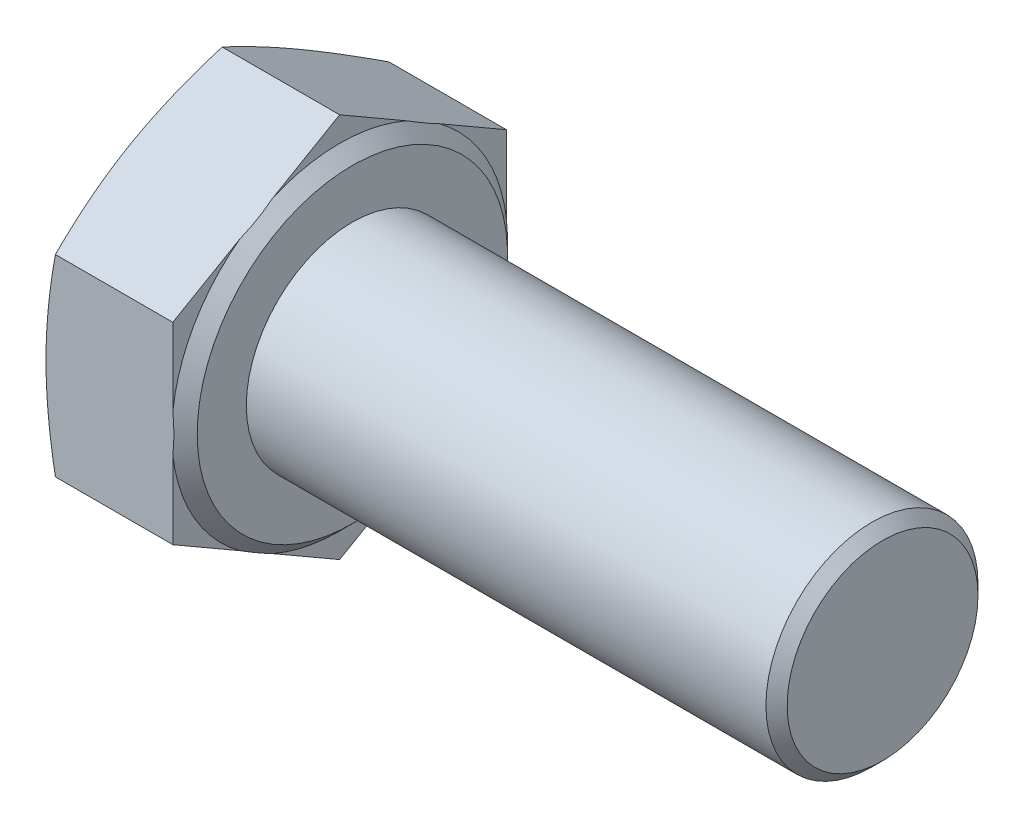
ISO-10303-21;
HEADER;
FILE_DESCRIPTION(('STEP AP214'),'2;1');
FILE_NAME('part.step','',(''),(''),'','','');
FILE_SCHEMA(('AUTOMOTIVE_DESIGN { 1 0 10303 214 1 1 1 1 }'));
ENDSEC;
DATA;
#1=APPLICATION_CONTEXT('core data for automotive mechanical design processes');
#2=APPLICATION_PROTOCOL_DEFINITION('international standard','automotive_design',2000,#1);
#3=PRODUCT_CONTEXT('',#1,'mechanical');
#4=PRODUCT('Part','Part','',(#3));
#5=PRODUCT_RELATED_PRODUCT_CATEGORY('part','',(#4));
#6=PRODUCT_DEFINITION_FORMATION('','',#4);
#7=PRODUCT_DEFINITION_CONTEXT('part definition',#1,'design');
#8=PRODUCT_DEFINITION('design','',#6,#7);
#9=PRODUCT_DEFINITION_SHAPE('','',#8);
#10=(LENGTH_UNIT() NAMED_UNIT(*) SI_UNIT(.MILLI.,.METRE.));
#11=(NAMED_UNIT(*) PLANE_ANGLE_UNIT() SI_UNIT($,.RADIAN.));
#12=(NAMED_UNIT(*) SI_UNIT($,.STERADIAN.) SOLID_ANGLE_UNIT());
#13=UNCERTAINTY_MEASURE_WITH_UNIT(LENGTH_MEASURE(1.E-05),#10,'distance_accuracy_value','');
#14=(GEOMETRIC_REPRESENTATION_CONTEXT(3) GLOBAL_UNCERTAINTY_ASSIGNED_CONTEXT((#13)) GLOBAL_UNIT_ASSIGNED_CONTEXT((#10,
#11,#12)) REPRESENTATION_CONTEXT('',''));
#15=CARTESIAN_POINT('',(0.,0.,0.));
#16=DIRECTION('',(0.,0.,1.));
#17=DIRECTION('',(1.,0.,0.));
#18=AXIS2_PLACEMENT_3D('',#15,#16,#17);
#19=CARTESIAN_POINT('',(6.58,-13.6225796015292,7.865));
#20=DIRECTION('',(-1.,0.,0.));
#21=DIRECTION('',(0.,0.,1.));
#22=AXIS2_PLACEMENT_3D('',#19,#20,#21);
#23=PLANE('',#22);
#24=CARTESIAN_POINT('',(6.58,0.,0.));
#25=DIRECTION('',(-1.,0.,0.));
#26=DIRECTION('',(0.,0.,1.));
#27=AXIS2_PLACEMENT_3D('',#24,#25,#26);
#28=CIRCLE('',#27,7.315);
#29=CARTESIAN_POINT('',(6.58,0.,7.315));
#30=VERTEX_POINT('',#29);
#31=EDGE_CURVE('E556',#30,#30,#28,.T.);
#32=ORIENTED_EDGE('',*,*,#31,.F.);
#33=EDGE_LOOP('',(#32));
#34=FACE_BOUND('',#33,.T.);
#35=CARTESIAN_POINT('',(6.58,0.,0.));
#36=DIRECTION('',(-1.,0.,0.));
#37=DIRECTION('',(0.,0.,1.));
#38=AXIS2_PLACEMENT_3D('',#35,#36,#37);
#39=CIRCLE('',#38,5.);
#40=CARTESIAN_POINT('',(6.58,0.,5.));
#41=VERTEX_POINT('',#40);
#42=EDGE_CURVE('E183',#41,#41,#39,.F.);
#43=ORIENTED_EDGE('',*,*,#42,.F.);
#44=EDGE_LOOP('',(#43));
#45=FACE_BOUND('',#44,.T.);
#46=ADVANCED_FACE('F30',(#34,#45),#23,.F.);
#47=CARTESIAN_POINT('',(6.58,-9.08171973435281,0.));
#48=DIRECTION('',(0.,0.866025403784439,0.5));
#49=DIRECTION('',(0.,-0.5,0.866025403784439));
#50=AXIS2_PLACEMENT_3D('',#47,#48,#49);
#51=PLANE('',#50);
#52=CARTESIAN_POINT('',(0.442891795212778,-4.54074439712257,-7.8652));
#53=CARTESIAN_POINT('',(0.374419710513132,-4.72880090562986,-7.53947657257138));
#54=CARTESIAN_POINT('',(0.31213253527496,-4.91747753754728,-7.21267905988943));
#55=CARTESIAN_POINT('',(0.202547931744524,-5.2960575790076,-6.55695919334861));
#56=CARTESIAN_POINT('',(0.155262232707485,-5.48596183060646,-6.22803538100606));
#57=CARTESIAN_POINT('',(0.0787789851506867,-5.86488964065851,-5.57171316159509));
#58=CARTESIAN_POINT('',(0.0494146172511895,-6.05390454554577,-5.24432974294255));
#59=CARTESIAN_POINT('',(0.0100287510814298,-6.43237636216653,-4.58879732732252));
#60=CARTESIAN_POINT('',(0.,-6.62183308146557,-4.26064866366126));
#61=CARTESIAN_POINT('',(0.,-7.00074652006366,-3.60435133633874));
#62=CARTESIAN_POINT('',(0.01002875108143,-7.1902032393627,-3.27620267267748));
#63=CARTESIAN_POINT('',(0.0494146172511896,-7.56867505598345,-2.62067025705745));
#64=CARTESIAN_POINT('',(0.0787789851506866,-7.75768996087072,-2.29328683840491));
#65=CARTESIAN_POINT('',(0.155262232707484,-8.13661777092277,-1.63696461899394));
#66=CARTESIAN_POINT('',(0.202547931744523,-8.32652202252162,-1.30804080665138));
#67=CARTESIAN_POINT('',(0.31213253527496,-8.70510206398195,-0.652320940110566));
#68=CARTESIAN_POINT('',(0.374419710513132,-8.89377869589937,-0.325523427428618));
#69=CARTESIAN_POINT('',(0.442891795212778,-9.08183520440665,0.000200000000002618));
#70=B_SPLINE_CURVE_WITH_KNOTS('',3,(#52,#53,#54,#55,#56,#57,#58,#59,#60,#61,#62,#63,#64,#65,#66,
#67,#68,#69),.UNSPECIFIED.,.F.,.F.,(4,2,2,2,2,2,2,2,4),(0.,1.14700314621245,2.29490090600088,
3.43194374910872,4.56856000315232,5.70517625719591,6.84221910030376,7.99011686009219,
9.13712000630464),.UNSPECIFIED.);
#71=CARTESIAN_POINT('',(0.442849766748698,-4.54085986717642,-7.865));
#72=VERTEX_POINT('',#71);
#73=CARTESIAN_POINT('',(0.,-6.81128980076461,-3.9325));
#74=VERTEX_POINT('',#73);
#75=EDGE_CURVE('E145',#72,#74,#70,.T.);
#76=ORIENTED_EDGE('',*,*,#75,.F.);
#77=DIRECTION('',(-1.,0.,0.));
#78=VECTOR('',#77,1.);
#79=CARTESIAN_POINT('',(6.58,-4.54085986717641,-7.865));
#80=LINE('',#79,#78);
#81=CARTESIAN_POINT('',(5.98,-4.54085986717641,-7.865));
#82=VERTEX_POINT('',#81);
#83=EDGE_CURVE('E174',#82,#72,#80,.T.);
#84=ORIENTED_EDGE('',*,*,#83,.F.);
#85=DIRECTION('',(0.,0.5,-0.866025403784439));
#86=VECTOR('',#85,1.);
#87=CARTESIAN_POINT('',(5.98,-9.08171973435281,0.));
#88=LINE('',#87,#86);
#89=CARTESIAN_POINT('',(5.98,-6.36716144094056,-4.7017528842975));
#90=VERTEX_POINT('',#89);
#91=EDGE_CURVE('E304',#90,#82,#88,.T.);
#92=ORIENTED_EDGE('',*,*,#91,.F.);
#93=CARTESIAN_POINT('',(5.9798,-7.25630835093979,-3.16170526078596));
#94=CARTESIAN_POINT('',(5.99646670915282,-7.18233435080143,-3.2898319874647));
#95=CARTESIAN_POINT('',(6.00903010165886,-7.10812502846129,-3.41836630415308));
#96=CARTESIAN_POINT('',(6.02578356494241,-6.95970657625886,-3.67543460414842));
#97=CARTESIAN_POINT('',(6.03,-6.88549818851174,-3.80396730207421));
#98=CARTESIAN_POINT('',(6.03,-6.73708141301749,-4.06103269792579));
#99=CARTESIAN_POINT('',(6.02578356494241,-6.66287302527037,-4.18956539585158));
#100=CARTESIAN_POINT('',(6.00903010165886,-6.51445457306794,-4.44663369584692));
#101=CARTESIAN_POINT('',(5.99646670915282,-6.44024525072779,-4.5751680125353));
#102=CARTESIAN_POINT('',(5.9798,-6.36627125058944,-4.70329473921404));
#103=B_SPLINE_CURVE_WITH_KNOTS('',3,(#93,#94,#95,#96,#97,#98,#99,#100,#101,#102),.UNSPECIFIED.,
.F.,.F.,(4,2,2,2,4),(0.,0.446607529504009,0.891802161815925,1.33699679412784,1.78360432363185),.UNSPECIFIED.);
#104=CARTESIAN_POINT('',(5.98,-7.25541816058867,-3.1632471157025));
#105=VERTEX_POINT('',#104);
#106=EDGE_CURVE('E291',#105,#90,#103,.T.);
#107=ORIENTED_EDGE('',*,*,#106,.F.);
#108=CARTESIAN_POINT('',(5.98,-9.08171973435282,0.));
#109=VERTEX_POINT('',#108);
#110=EDGE_CURVE('E301',#109,#105,#88,.T.);
#111=ORIENTED_EDGE('',*,*,#110,.F.);
#112=DIRECTION('',(-1.,0.,0.));
#113=VECTOR('',#112,1.);
#114=CARTESIAN_POINT('',(6.58,-9.08171973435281,0.));
#115=LINE('',#114,#113);
#116=CARTESIAN_POINT('',(0.442849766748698,-9.08171973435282,0.));
#117=VERTEX_POINT('',#116);
#118=EDGE_CURVE('E168',#109,#117,#115,.T.);
#119=ORIENTED_EDGE('',*,*,#118,.T.);
#120=EDGE_CURVE('E258',#74,#117,#70,.T.);
#121=ORIENTED_EDGE('',*,*,#120,.F.);
#122=EDGE_LOOP('',(#76,#84,#92,#107,#111,#119,#121));
#123=FACE_BOUND('',#122,.T.);
#124=ADVANCED_FACE('F199',(#123),#51,.F.);
#125=CARTESIAN_POINT('',(6.58,-4.54085986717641,-7.865));
#126=DIRECTION('',(0.,0.,1.));
#127=DIRECTION('',(1.,0.,0.));
#128=AXIS2_PLACEMENT_3D('',#125,#126,#127);
#129=PLANE('',#128);
#130=CARTESIAN_POINT('',(2.36641352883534,-12.0226002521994,-7.865));
#131=CARTESIAN_POINT('',(2.2580600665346,-11.6667592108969,-7.865));
#132=CARTESIAN_POINT('',(2.15097094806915,-11.3105260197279,-7.865));
#133=CARTESIAN_POINT('',(1.94002083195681,-10.5970756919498,-7.865));
#134=CARTESIAN_POINT('',(1.83616008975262,-10.2398584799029,-7.865));
#135=CARTESIAN_POINT('',(1.63219338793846,-9.52362904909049,-7.865));
#136=CARTESIAN_POINT('',(1.53209479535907,-9.16461472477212,-7.865));
#137=CARTESIAN_POINT('',(1.33682427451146,-8.44525058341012,-7.865));
#138=CARTESIAN_POINT('',(1.24165225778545,-8.08490079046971,-7.865));
#139=CARTESIAN_POINT('',(1.05859053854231,-7.36707846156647,-7.865));
#140=CARTESIAN_POINT('',(0.970625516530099,-7.00962522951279,-7.865));
#141=CARTESIAN_POINT('',(0.802184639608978,-6.29294003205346,-7.865));
#142=CARTESIAN_POINT('',(0.721708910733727,-5.93370803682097,-7.865));
#143=CARTESIAN_POINT('',(0.570122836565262,-5.21338493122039,-7.865));
#144=CARTESIAN_POINT('',(0.499009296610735,-4.85229449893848,-7.865));
#145=CARTESIAN_POINT('',(0.368312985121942,-4.12801725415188,-7.865));
#146=CARTESIAN_POINT('',(0.308729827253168,-3.76483051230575,-7.865));
#147=CARTESIAN_POINT('',(0.209414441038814,-3.07725690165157,-7.865));
#148=CARTESIAN_POINT('',(0.168205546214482,-2.7530853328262,-7.865));
#149=CARTESIAN_POINT('',(0.0984487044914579,-2.10337143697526,-7.865));
#150=CARTESIAN_POINT('',(0.0699003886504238,-1.77782915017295,-7.865));
#151=CARTESIAN_POINT('',(0.0268395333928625,-1.12603413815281,-7.865));
#152=CARTESIAN_POINT('',(0.0123170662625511,-0.799782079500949,-7.865));
#153=CARTESIAN_POINT('',(-0.00195682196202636,-0.14695155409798,-7.865));
#154=CARTESIAN_POINT('',(-0.00170834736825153,0.179626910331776,-7.865));
#155=CARTESIAN_POINT('',(0.013584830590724,0.834088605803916,-7.865));
#156=CARTESIAN_POINT('',(0.0287045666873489,1.1619700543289,-7.865));
#157=CARTESIAN_POINT('',(0.0730444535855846,1.81676988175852,-7.865));
#158=CARTESIAN_POINT('',(0.102264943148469,2.14368823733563,-7.865));
#159=CARTESIAN_POINT('',(0.173439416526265,2.79640045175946,-7.865));
#160=CARTESIAN_POINT('',(0.215404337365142,3.12219310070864,-7.865));
#161=CARTESIAN_POINT('',(0.310365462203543,3.77214853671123,-7.865));
#162=CARTESIAN_POINT('',(0.36336172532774,4.09631131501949,-7.865));
#163=CARTESIAN_POINT('',(0.48171036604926,4.76006524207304,-7.865));
#164=CARTESIAN_POINT('',(0.54756804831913,5.09956549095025,-7.865));
#165=CARTESIAN_POINT('',(0.68775969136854,5.77682257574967,-7.865));
#166=CARTESIAN_POINT('',(0.762094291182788,6.11457927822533,-7.865));
#167=CARTESIAN_POINT('',(0.91767888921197,6.78858995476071,-7.865));
#168=CARTESIAN_POINT('',(0.998930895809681,7.12484346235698,-7.865));
#169=CARTESIAN_POINT('',(1.16702859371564,7.79593398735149,-7.865));
#170=CARTESIAN_POINT('',(1.25387415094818,8.1307710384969,-7.865));
#171=CARTESIAN_POINT('',(1.43222777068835,8.79965725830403,-7.865));
#172=CARTESIAN_POINT('',(1.52374167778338,9.13370486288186,-7.865));
#173=CARTESIAN_POINT('',(1.71049239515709,9.80075635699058,-7.865));
#174=CARTESIAN_POINT('',(1.80572922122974,10.1337602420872,-7.865));
#175=CARTESIAN_POINT('',(1.99924297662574,10.7988194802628,-7.865));
#176=CARTESIAN_POINT('',(2.09751937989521,11.1308749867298,-7.865));
#177=CARTESIAN_POINT('',(2.29660417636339,11.7942269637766,-7.865));
#178=CARTESIAN_POINT('',(2.39741258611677,12.1255234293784,-7.865));
#179=CARTESIAN_POINT('',(2.7007312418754,13.1111316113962,-7.865));
#180=CARTESIAN_POINT('',(2.90629348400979,13.7645038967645,-7.865));
#181=CARTESIAN_POINT('',(3.32324319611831,15.0694121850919,-7.865));
#182=CARTESIAN_POINT('',(3.53463094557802,15.7209480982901,-7.865));
#183=CARTESIAN_POINT('',(3.96086805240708,17.0201471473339,-7.865));
#184=CARTESIAN_POINT('',(4.17570123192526,17.6678155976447,-7.865));
#185=CARTESIAN_POINT('',(4.50033413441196,18.6384901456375,-7.865));
#186=CARTESIAN_POINT('',(4.60893786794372,18.9618972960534,-7.865));
#187=CARTESIAN_POINT('',(4.82684807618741,19.6084739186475,-7.865));
#188=CARTESIAN_POINT('',(4.93615454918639,19.9316433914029,-7.865));
#189=CARTESIAN_POINT('',(5.04576544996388,20.2547096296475,-7.865));
#190=B_SPLINE_CURVE_WITH_KNOTS('',3,(#130,#131,#132,#133,#134,#135,#136,#137,#138,#139,#140,
#141,#142,#143,#144,#145,#146,#147,#148,#149,#150,#151,#152,#153,#154,#155,#156,#157,#158,#159,
#160,#161,#162,#163,#164,#165,#166,#167,#168,#169,#170,#171,#172,#173,#174,#175,#176,#177,#178,
#179,#180,#181,#182,#183,#184,#185,#186,#187,#188,#189),.UNSPECIFIED.,.F.,.F.,(4,2,2,2,2,2,2,2,
2,2,2,2,2,2,2,2,2,2,2,2,2,2,2,2,2,2,2,2,2,4),(0.,1.11592451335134,2.23193709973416,
3.35003188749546,4.46810659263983,5.57239601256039,6.67670401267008,7.78063420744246,
8.88452740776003,9.86465314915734,10.8447503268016,11.8241532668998,12.8035492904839,
13.7879123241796,14.7722990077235,15.7575328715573,16.7427720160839,17.78012614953,
18.8175585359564,19.8552931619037,20.8930029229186,21.9320453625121,22.971092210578,
24.0099602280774,25.0488350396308,27.1036289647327,29.1585216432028,31.2056173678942,
32.2290827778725,33.2525456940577),.UNSPECIFIED.);
#191=CARTESIAN_POINT('',(0.442849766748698,4.54085986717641,-7.865));
#192=VERTEX_POINT('',#191);
#193=CARTESIAN_POINT('',(0.,0.,-7.865));
#194=VERTEX_POINT('',#193);
#195=EDGE_CURVE('E270',#192,#194,#190,.F.);
#196=ORIENTED_EDGE('',*,*,#195,.F.);
#197=DIRECTION('',(-1.,0.,0.));
#198=VECTOR('',#197,1.);
#199=CARTESIAN_POINT('',(6.58,4.54085986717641,-7.865));
#200=LINE('',#199,#198);
#201=CARTESIAN_POINT('',(5.98,4.54085986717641,-7.865));
#202=VERTEX_POINT('',#201);
#203=EDGE_CURVE('E165',#202,#192,#200,.T.);
#204=ORIENTED_EDGE('',*,*,#203,.F.);
#205=DIRECTION('',(0.,1.,0.));
#206=VECTOR('',#205,1.);
#207=CARTESIAN_POINT('',(5.98,-4.54085986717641,-7.865));
#208=LINE('',#207,#206);
#209=CARTESIAN_POINT('',(5.98,0.888256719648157,-7.865));
#210=VERTEX_POINT('',#209);
#211=EDGE_CURVE('E312',#210,#202,#208,.T.);
#212=ORIENTED_EDGE('',*,*,#211,.F.);
#213=CARTESIAN_POINT('',(4.95281448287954,-4.25493323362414,-7.865));
#214=CARTESIAN_POINT('',(5.07224674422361,-4.0038176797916,-7.865));
#215=CARTESIAN_POINT('',(5.1852007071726,-3.74935435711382,-7.865));
#216=CARTESIAN_POINT('',(5.39477690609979,-3.23290692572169,-7.865));
#217=CARTESIAN_POINT('',(5.49134731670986,-2.97090190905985,-7.865));
#218=CARTESIAN_POINT('',(5.66341320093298,-2.44188823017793,-7.865));
#219=CARTESIAN_POINT('',(5.7390458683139,-2.17492499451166,-7.865));
#220=CARTESIAN_POINT('',(5.86601117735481,-1.6355184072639,-7.865));
#221=CARTESIAN_POINT('',(5.91737529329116,-1.36308263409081,-7.865));
#222=CARTESIAN_POINT('',(5.98170365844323,-0.894044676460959,-7.865));
#223=CARTESIAN_POINT('',(6.0014844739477,-0.698365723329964,-7.865));
#224=CARTESIAN_POINT('',(6.02648132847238,-0.306035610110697,-7.865));
#225=CARTESIAN_POINT('',(6.03169564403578,-0.109384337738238,-7.865));
#226=CARTESIAN_POINT('',(6.02733646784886,0.283885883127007,-7.865));
#227=CARTESIAN_POINT('',(6.01775297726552,0.480504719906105,-7.865));
#228=CARTESIAN_POINT('',(5.98416907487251,0.872456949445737,-7.865));
#229=CARTESIAN_POINT('',(5.96017040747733,1.06779049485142,-7.865));
#230=CARTESIAN_POINT('',(5.88319291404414,1.55355431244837,-7.865));
#231=CARTESIAN_POINT('',(5.82172156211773,1.84265691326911,-7.865));
#232=CARTESIAN_POINT('',(5.67244236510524,2.41426382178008,-7.865));
#233=CARTESIAN_POINT('',(5.58459433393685,2.69675734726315,-7.865));
#234=CARTESIAN_POINT('',(5.38697042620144,3.25528983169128,-7.865));
#235=CARTESIAN_POINT('',(5.27709906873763,3.53129462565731,-7.865));
#236=CARTESIAN_POINT('',(5.09956194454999,3.93908690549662,-7.865));
#237=CARTESIAN_POINT('',(5.03837569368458,4.07375872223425,-7.865));
#238=CARTESIAN_POINT('',(4.91219062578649,4.34125726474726,-7.865));
#239=CARTESIAN_POINT('',(4.8471929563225,4.47408453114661,-7.865));
#240=CARTESIAN_POINT('',(4.78050524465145,4.60606010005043,-7.865));
#241=B_SPLINE_CURVE_WITH_KNOTS('',3,(#213,#214,#215,#216,#217,#218,#219,#220,#221,#222,#223,
#224,#225,#226,#227,#228,#229,#230,#231,#232,#233,#234,#235,#236,#237,#238,#239,#240),
.UNSPECIFIED.,.F.,.F.,(4,2,2,2,2,2,2,2,2,2,2,2,2,4),(0.,0.834481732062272,1.67155582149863,
2.50300768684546,3.33337824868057,3.92290979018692,4.51251108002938,5.10251093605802,
5.69243940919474,6.57758291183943,7.46408187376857,8.35451073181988,8.7982229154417,
9.24180218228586),.UNSPECIFIED.);
#242=CARTESIAN_POINT('',(5.98,-0.888256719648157,-7.865));
#243=VERTEX_POINT('',#242);
#244=EDGE_CURVE('E285',#243,#210,#241,.T.);
#245=ORIENTED_EDGE('',*,*,#244,.F.);
#246=EDGE_CURVE('E313',#82,#243,#208,.T.);
#247=ORIENTED_EDGE('',*,*,#246,.F.);
#248=ORIENTED_EDGE('',*,*,#83,.T.);
#249=EDGE_CURVE('E156',#194,#72,#190,.F.);
#250=ORIENTED_EDGE('',*,*,#249,.F.);
#251=EDGE_LOOP('',(#196,#204,#212,#245,#247,#248,#250));
#252=FACE_BOUND('',#251,.T.);
#253=ADVANCED_FACE('F205',(#252),#129,.F.);
#254=CARTESIAN_POINT('',(6.58,4.54085986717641,-7.865));
#255=DIRECTION('',(0.,-0.866025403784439,0.5));
#256=DIRECTION('',(0.,-0.5,-0.866025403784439));
#257=AXIS2_PLACEMENT_3D('',#254,#255,#256);
#258=PLANE('',#257);
#259=CARTESIAN_POINT('',(0.442891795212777,9.08183520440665,0.000199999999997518));
#260=CARTESIAN_POINT('',(0.374419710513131,8.89377869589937,-0.325523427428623));
#261=CARTESIAN_POINT('',(0.31213253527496,8.70510206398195,-0.652320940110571));
#262=CARTESIAN_POINT('',(0.202547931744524,8.32652202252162,-1.30804080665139));
#263=CARTESIAN_POINT('',(0.155262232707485,8.13661777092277,-1.63696461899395));
#264=CARTESIAN_POINT('',(0.0787789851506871,7.75768996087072,-2.29328683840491));
#265=CARTESIAN_POINT('',(0.0494146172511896,7.56867505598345,-2.62067025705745));
#266=CARTESIAN_POINT('',(0.01002875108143,7.1902032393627,-3.27620267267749));
#267=CARTESIAN_POINT('',(0.,7.00074652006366,-3.60435133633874));
#268=CARTESIAN_POINT('',(0.,6.62183308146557,-4.26064866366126));
#269=CARTESIAN_POINT('',(0.0100287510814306,6.43237636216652,-4.58879732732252));
#270=CARTESIAN_POINT('',(0.0494146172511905,6.05390454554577,-5.24432974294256));
#271=CARTESIAN_POINT('',(0.0787789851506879,5.86488964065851,-5.57171316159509));
#272=CARTESIAN_POINT('',(0.155262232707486,5.48596183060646,-6.22803538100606));
#273=CARTESIAN_POINT('',(0.202547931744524,5.2960575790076,-6.55695919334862));
#274=CARTESIAN_POINT('',(0.31213253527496,4.91747753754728,-7.21267905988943));
#275=CARTESIAN_POINT('',(0.374419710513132,4.72880090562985,-7.53947657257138));
#276=CARTESIAN_POINT('',(0.442891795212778,4.54074439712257,-7.8652));
#277=B_SPLINE_CURVE_WITH_KNOTS('',3,(#259,#260,#261,#262,#263,#264,#265,#266,#267,#268,#269,
#270,#271,#272,#273,#274,#275,#276),.UNSPECIFIED.,.F.,.F.,(4,2,2,2,2,2,2,2,4),(0.,
1.14700314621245,2.29490090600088,3.43194374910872,4.56856000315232,5.70517625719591,
6.84221910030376,7.99011686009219,9.13712000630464),.UNSPECIFIED.);
#278=CARTESIAN_POINT('',(0.442849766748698,9.08171973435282,0.));
#279=VERTEX_POINT('',#278);
#280=CARTESIAN_POINT('',(0.,6.81128980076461,-3.9325));
#281=VERTEX_POINT('',#280);
#282=EDGE_CURVE('E542',#279,#281,#277,.T.);
#283=ORIENTED_EDGE('',*,*,#282,.F.);
#284=DIRECTION('',(-1.,0.,0.));
#285=VECTOR('',#284,1.);
#286=CARTESIAN_POINT('',(6.58,9.08171973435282,0.));
#287=LINE('',#286,#285);
#288=CARTESIAN_POINT('',(5.98,9.08171973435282,0.));
#289=VERTEX_POINT('',#288);
#290=EDGE_CURVE('E162',#289,#279,#287,.T.);
#291=ORIENTED_EDGE('',*,*,#290,.F.);
#292=DIRECTION('',(0.,0.5,0.866025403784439));
#293=VECTOR('',#292,1.);
#294=CARTESIAN_POINT('',(5.98,4.54085986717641,-7.865));
#295=LINE('',#294,#293);
#296=CARTESIAN_POINT('',(5.98,7.25541816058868,-3.16324711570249));
#297=VERTEX_POINT('',#296);
#298=EDGE_CURVE('E309',#297,#289,#295,.T.);
#299=ORIENTED_EDGE('',*,*,#298,.F.);
#300=CARTESIAN_POINT('',(5.9798,6.36627125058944,-4.70329473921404));
#301=CARTESIAN_POINT('',(5.99646670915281,6.4402452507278,-4.5751680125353));
#302=CARTESIAN_POINT('',(6.00903010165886,6.51445457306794,-4.44663369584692));
#303=CARTESIAN_POINT('',(6.0257835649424,6.66287302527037,-4.18956539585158));
#304=CARTESIAN_POINT('',(6.03,6.73708141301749,-4.06103269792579));
#305=CARTESIAN_POINT('',(6.03,6.88549818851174,-3.80396730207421));
#306=CARTESIAN_POINT('',(6.02578356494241,6.95970657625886,-3.67543460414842));
#307=CARTESIAN_POINT('',(6.00903010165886,7.10812502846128,-3.41836630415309));
#308=CARTESIAN_POINT('',(5.99646670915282,7.18233435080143,-3.28983198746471));
#309=CARTESIAN_POINT('',(5.9798,7.25630835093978,-3.16170526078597));
#310=B_SPLINE_CURVE_WITH_KNOTS('',3,(#300,#301,#302,#303,#304,#305,#306,#307,#308,#309),
.UNSPECIFIED.,.F.,.F.,(4,2,2,2,4),(0.,0.446607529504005,0.891802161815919,1.33699679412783,
1.78360432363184),.UNSPECIFIED.);
#311=CARTESIAN_POINT('',(5.98,6.36716144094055,-4.70175288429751));
#312=VERTEX_POINT('',#311);
#313=EDGE_CURVE('E292',#312,#297,#310,.T.);
#314=ORIENTED_EDGE('',*,*,#313,.F.);
#315=EDGE_CURVE('E311',#202,#312,#295,.T.);
#316=ORIENTED_EDGE('',*,*,#315,.F.);
#317=ORIENTED_EDGE('',*,*,#203,.T.);
#318=EDGE_CURVE('E271',#281,#192,#277,.T.);
#319=ORIENTED_EDGE('',*,*,#318,.F.);
#320=EDGE_LOOP('',(#283,#291,#299,#314,#316,#317,#319));
#321=FACE_BOUND('',#320,.T.);
#322=ADVANCED_FACE('F279',(#321),#258,.F.);
#323=CARTESIAN_POINT('',(6.58,9.08171973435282,0.));
#324=DIRECTION('',(0.,-0.866025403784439,-0.5));
#325=DIRECTION('',(0.,0.5,-0.866025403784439));
#326=AXIS2_PLACEMENT_3D('',#323,#324,#325);
#327=PLANE('',#326);
#328=CARTESIAN_POINT('',(0.442891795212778,4.54074439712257,7.8652));
#329=CARTESIAN_POINT('',(0.374419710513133,4.72880090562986,7.53947657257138));
#330=CARTESIAN_POINT('',(0.312132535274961,4.91747753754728,7.21267905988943));
#331=CARTESIAN_POINT('',(0.202547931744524,5.2960575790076,6.55695919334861));
#332=CARTESIAN_POINT('',(0.155262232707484,5.48596183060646,6.22803538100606));
#333=CARTESIAN_POINT('',(0.0787789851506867,5.86488964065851,5.57171316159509));
#334=CARTESIAN_POINT('',(0.0494146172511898,6.05390454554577,5.24432974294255));
#335=CARTESIAN_POINT('',(0.0100287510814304,6.43237636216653,4.58879732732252));
#336=CARTESIAN_POINT('',(0.,6.62183308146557,4.26064866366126));
#337=CARTESIAN_POINT('',(0.,7.00074652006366,3.60435133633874));
#338=CARTESIAN_POINT('',(0.0100287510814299,7.1902032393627,3.27620267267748));
#339=CARTESIAN_POINT('',(0.0494146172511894,7.56867505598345,2.62067025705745));
#340=CARTESIAN_POINT('',(0.0787789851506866,7.75768996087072,2.29328683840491));
#341=CARTESIAN_POINT('',(0.155262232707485,8.13661777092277,1.63696461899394));
#342=CARTESIAN_POINT('',(0.202547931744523,8.32652202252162,1.30804080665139));
#343=CARTESIAN_POINT('',(0.31213253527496,8.70510206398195,0.652320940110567));
#344=CARTESIAN_POINT('',(0.374419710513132,8.89377869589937,0.325523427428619));
#345=CARTESIAN_POINT('',(0.442891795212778,9.08183520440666,-0.000200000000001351));
#346=B_SPLINE_CURVE_WITH_KNOTS('',3,(#328,#329,#330,#331,#332,#333,#334,#335,#336,#337,#338,
#339,#340,#341,#342,#343,#344,#345),.UNSPECIFIED.,.F.,.F.,(4,2,2,2,2,2,2,2,4),(0.,
1.14700314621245,2.29490090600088,3.43194374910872,4.56856000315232,5.70517625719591,
6.84221910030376,7.99011686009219,9.13712000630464),.UNSPECIFIED.);
#347=CARTESIAN_POINT('',(0.442849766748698,4.54085986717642,7.865));
#348=VERTEX_POINT('',#347);
#349=CARTESIAN_POINT('',(0.,6.81128980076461,3.9325));
#350=VERTEX_POINT('',#349);
#351=EDGE_CURVE('E140',#348,#350,#346,.T.);
#352=ORIENTED_EDGE('',*,*,#351,.F.);
#353=DIRECTION('',(-1.,0.,0.));
#354=VECTOR('',#353,1.);
#355=CARTESIAN_POINT('',(6.58,4.54085986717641,7.865));
#356=LINE('',#355,#354);
#357=CARTESIAN_POINT('',(5.98,4.54085986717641,7.865));
#358=VERTEX_POINT('',#357);
#359=EDGE_CURVE('E153',#358,#348,#356,.T.);
#360=ORIENTED_EDGE('',*,*,#359,.F.);
#361=DIRECTION('',(0.,-0.5,0.866025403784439));
#362=VECTOR('',#361,1.);
#363=CARTESIAN_POINT('',(5.98,9.08171973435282,0.));
#364=LINE('',#363,#362);
#365=CARTESIAN_POINT('',(5.98,6.36716144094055,4.70175288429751));
#366=VERTEX_POINT('',#365);
#367=EDGE_CURVE('E306',#366,#358,#364,.T.);
#368=ORIENTED_EDGE('',*,*,#367,.F.);
#369=CARTESIAN_POINT('',(5.9798,7.25630835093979,3.16170526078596));
#370=CARTESIAN_POINT('',(5.99646670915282,7.18233435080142,3.28983198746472));
#371=CARTESIAN_POINT('',(6.00903010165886,7.10812502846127,3.41836630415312));
#372=CARTESIAN_POINT('',(6.02578356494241,6.95970657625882,3.67543460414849));
#373=CARTESIAN_POINT('',(6.03,6.88549818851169,3.8039673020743));
#374=CARTESIAN_POINT('',(6.03,6.73708141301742,4.06103269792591));
#375=CARTESIAN_POINT('',(6.0257835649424,6.66287302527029,4.18956539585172));
#376=CARTESIAN_POINT('',(6.00903010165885,6.51445457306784,4.44663369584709));
#377=CARTESIAN_POINT('',(5.9964667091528,6.44024525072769,4.57516801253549));
#378=CARTESIAN_POINT('',(5.97979999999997,6.36627125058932,4.70329473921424));
#379=B_SPLINE_CURVE_WITH_KNOTS('',3,(#369,#370,#371,#372,#373,#374,#375,#376,#377,#378),
.UNSPECIFIED.,.F.,.F.,(4,2,2,2,4),(0.,0.446607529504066,0.89180216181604,1.33699679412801,
1.78360432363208),.UNSPECIFIED.);
#380=CARTESIAN_POINT('',(5.98,7.25541816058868,3.16324711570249));
#381=VERTEX_POINT('',#380);
#382=EDGE_CURVE('E347',#381,#366,#379,.T.);
#383=ORIENTED_EDGE('',*,*,#382,.F.);
#384=EDGE_CURVE('E308',#289,#381,#364,.T.);
#385=ORIENTED_EDGE('',*,*,#384,.F.);
#386=ORIENTED_EDGE('',*,*,#290,.T.);
#387=EDGE_CURVE('E155',#350,#279,#346,.T.);
#388=ORIENTED_EDGE('',*,*,#387,.F.);
#389=EDGE_LOOP('',(#352,#360,#368,#383,#385,#386,#388));
#390=FACE_BOUND('',#389,.T.);
#391=ADVANCED_FACE('F151',(#390),#327,.F.);
#392=CARTESIAN_POINT('',(6.58,4.54085986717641,7.865));
#393=DIRECTION('',(0.,0.,-1.));
#394=DIRECTION('',(-1.,0.,0.));
#395=AXIS2_PLACEMENT_3D('',#392,#393,#394);
#396=PLANE('',#395);
#397=CARTESIAN_POINT('',(2.36641352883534,-12.0226002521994,7.865));
#398=CARTESIAN_POINT('',(2.2580600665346,-11.6667592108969,7.865));
#399=CARTESIAN_POINT('',(2.15097094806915,-11.3105260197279,7.865));
#400=CARTESIAN_POINT('',(1.94002083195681,-10.5970756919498,7.865));
#401=CARTESIAN_POINT('',(1.83616008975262,-10.2398584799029,7.865));
#402=CARTESIAN_POINT('',(1.63219338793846,-9.52362904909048,7.865));
#403=CARTESIAN_POINT('',(1.53209479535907,-9.16461472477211,7.865));
#404=CARTESIAN_POINT('',(1.33682427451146,-8.44525058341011,7.865));
#405=CARTESIAN_POINT('',(1.24165225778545,-8.0849007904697,7.865));
#406=CARTESIAN_POINT('',(1.0585905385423,-7.36707846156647,7.865));
#407=CARTESIAN_POINT('',(0.970625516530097,-7.00962522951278,7.865));
#408=CARTESIAN_POINT('',(0.802184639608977,-6.29294003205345,7.865));
#409=CARTESIAN_POINT('',(0.721708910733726,-5.93370803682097,7.865));
#410=CARTESIAN_POINT('',(0.570122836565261,-5.21338493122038,7.865));
#411=CARTESIAN_POINT('',(0.499009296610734,-4.85229449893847,7.865));
#412=CARTESIAN_POINT('',(0.368312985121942,-4.12801725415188,7.865));
#413=CARTESIAN_POINT('',(0.308729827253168,-3.76483051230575,7.865));
#414=CARTESIAN_POINT('',(0.209414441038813,-3.07725690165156,7.865));
#415=CARTESIAN_POINT('',(0.168205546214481,-2.75308533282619,7.865));
#416=CARTESIAN_POINT('',(0.0984487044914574,-2.10337143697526,7.865));
#417=CARTESIAN_POINT('',(0.0699003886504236,-1.77782915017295,7.865));
#418=CARTESIAN_POINT('',(0.0268395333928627,-1.1260341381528,7.865));
#419=CARTESIAN_POINT('',(0.0123170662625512,-0.799782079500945,7.865));
#420=CARTESIAN_POINT('',(-0.00195682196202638,-0.146951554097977,7.865));
#421=CARTESIAN_POINT('',(-0.00170834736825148,0.179626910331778,7.865));
#422=CARTESIAN_POINT('',(0.013584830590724,0.834088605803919,7.865));
#423=CARTESIAN_POINT('',(0.0287045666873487,1.1619700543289,7.865));
#424=CARTESIAN_POINT('',(0.0730444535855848,1.81676988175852,7.865));
#425=CARTESIAN_POINT('',(0.10226494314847,2.14368823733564,7.865));
#426=CARTESIAN_POINT('',(0.173439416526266,2.79640045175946,7.865));
#427=CARTESIAN_POINT('',(0.215404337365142,3.12219310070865,7.865));
#428=CARTESIAN_POINT('',(0.310365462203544,3.77214853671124,7.865));
#429=CARTESIAN_POINT('',(0.363361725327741,4.09631131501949,7.865));
#430=CARTESIAN_POINT('',(0.481710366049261,4.76006524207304,7.865));
#431=CARTESIAN_POINT('',(0.547568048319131,5.09956549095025,7.865));
#432=CARTESIAN_POINT('',(0.68775969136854,5.77682257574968,7.865));
#433=CARTESIAN_POINT('',(0.762094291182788,6.11457927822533,7.865));
#434=CARTESIAN_POINT('',(0.91767888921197,6.78858995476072,7.865));
#435=CARTESIAN_POINT('',(0.998930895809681,7.12484346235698,7.865));
#436=CARTESIAN_POINT('',(1.16702859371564,7.7959339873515,7.865));
#437=CARTESIAN_POINT('',(1.25387415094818,8.13077103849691,7.865));
#438=CARTESIAN_POINT('',(1.43222777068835,8.79965725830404,7.865));
#439=CARTESIAN_POINT('',(1.52374167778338,9.13370486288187,7.865));
#440=CARTESIAN_POINT('',(1.71049239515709,9.80075635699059,7.865));
#441=CARTESIAN_POINT('',(1.80572922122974,10.1337602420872,7.865));
#442=CARTESIAN_POINT('',(1.99924297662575,10.7988194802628,7.865));
#443=CARTESIAN_POINT('',(2.09751937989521,11.1308749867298,7.865));
#444=CARTESIAN_POINT('',(2.29660417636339,11.7942269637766,7.865));
#445=CARTESIAN_POINT('',(2.39741258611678,12.1255234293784,7.865));
#446=CARTESIAN_POINT('',(2.7007312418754,13.1111316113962,7.865));
#447=CARTESIAN_POINT('',(2.90629348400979,13.7645038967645,7.865));
#448=CARTESIAN_POINT('',(3.32324319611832,15.0694121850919,7.865));
#449=CARTESIAN_POINT('',(3.53463094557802,15.7209480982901,7.865));
#450=CARTESIAN_POINT('',(3.96086805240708,17.0201471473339,7.865));
#451=CARTESIAN_POINT('',(4.17570123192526,17.6678155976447,7.865));
#452=CARTESIAN_POINT('',(4.50033413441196,18.6384901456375,7.865));
#453=CARTESIAN_POINT('',(4.60893786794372,18.9618972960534,7.865));
#454=CARTESIAN_POINT('',(4.82684807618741,19.6084739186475,7.865));
#455=CARTESIAN_POINT('',(4.93615454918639,19.9316433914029,7.865));
#456=CARTESIAN_POINT('',(5.04576544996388,20.2547096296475,7.865));
#457=B_SPLINE_CURVE_WITH_KNOTS('',3,(#397,#398,#399,#400,#401,#402,#403,#404,#405,#406,#407,
#408,#409,#410,#411,#412,#413,#414,#415,#416,#417,#418,#419,#420,#421,#422,#423,#424,#425,#426,
#427,#428,#429,#430,#431,#432,#433,#434,#435,#436,#437,#438,#439,#440,#441,#442,#443,#444,#445,
#446,#447,#448,#449,#450,#451,#452,#453,#454,#455,#456),.UNSPECIFIED.,.F.,.F.,(4,2,2,2,2,2,2,2,
2,2,2,2,2,2,2,2,2,2,2,2,2,2,2,2,2,2,2,2,2,4),(0.,1.11592451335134,2.23193709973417,
3.35003188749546,4.46810659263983,5.5723960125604,6.67670401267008,7.78063420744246,
8.88452740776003,9.86465314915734,10.8447503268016,11.8241532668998,12.8035492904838,
13.7879123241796,14.7722990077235,15.7575328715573,16.7427720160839,17.78012614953,
18.8175585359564,19.8552931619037,20.8930029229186,21.9320453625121,22.971092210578,
24.0099602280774,25.0488350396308,27.1036289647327,29.1585216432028,31.2056173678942,
32.2290827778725,33.2525456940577),.UNSPECIFIED.);
#458=CARTESIAN_POINT('',(0.442849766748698,-4.5408598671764,7.86500000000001));
#459=VERTEX_POINT('',#458);
#460=CARTESIAN_POINT('',(0.,0.,7.865));
#461=VERTEX_POINT('',#460);
#462=EDGE_CURVE('E147',#459,#461,#457,.T.);
#463=ORIENTED_EDGE('',*,*,#462,.F.);
#464=DIRECTION('',(-1.,0.,0.));
#465=VECTOR('',#464,1.);
#466=CARTESIAN_POINT('',(6.58,-4.54085986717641,7.865));
#467=LINE('',#466,#465);
#468=CARTESIAN_POINT('',(5.98,-4.54085986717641,7.865));
#469=VERTEX_POINT('',#468);
#470=EDGE_CURVE('E163',#469,#459,#467,.T.);
#471=ORIENTED_EDGE('',*,*,#470,.F.);
#472=DIRECTION('',(0.,-1.,0.));
#473=VECTOR('',#472,1.);
#474=CARTESIAN_POINT('',(5.98,4.54085986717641,7.865));
#475=LINE('',#474,#473);
#476=CARTESIAN_POINT('',(5.98,-0.888256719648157,7.865));
#477=VERTEX_POINT('',#476);
#478=EDGE_CURVE('E303',#477,#469,#475,.T.);
#479=ORIENTED_EDGE('',*,*,#478,.F.);
#480=CARTESIAN_POINT('',(4.95281448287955,-4.25493323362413,7.865));
#481=CARTESIAN_POINT('',(5.07224674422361,-4.00381767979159,7.865));
#482=CARTESIAN_POINT('',(5.1852007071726,-3.74935435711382,7.865));
#483=CARTESIAN_POINT('',(5.3947769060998,-3.23290692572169,7.865));
#484=CARTESIAN_POINT('',(5.49134731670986,-2.97090190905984,7.865));
#485=CARTESIAN_POINT('',(5.66341320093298,-2.44188823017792,7.865));
#486=CARTESIAN_POINT('',(5.7390458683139,-2.17492499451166,7.865));
#487=CARTESIAN_POINT('',(5.86601117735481,-1.6355184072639,7.865));
#488=CARTESIAN_POINT('',(5.91737529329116,-1.36308263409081,7.865));
#489=CARTESIAN_POINT('',(5.98170365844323,-0.894044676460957,7.865));
#490=CARTESIAN_POINT('',(6.0014844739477,-0.698365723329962,7.865));
#491=CARTESIAN_POINT('',(6.02648132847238,-0.306035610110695,7.865));
#492=CARTESIAN_POINT('',(6.03169564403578,-0.109384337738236,7.865));
#493=CARTESIAN_POINT('',(6.02733646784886,0.283885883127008,7.865));
#494=CARTESIAN_POINT('',(6.01775297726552,0.480504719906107,7.865));
#495=CARTESIAN_POINT('',(5.98416907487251,0.87245694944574,7.865));
#496=CARTESIAN_POINT('',(5.96017040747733,1.06779049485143,7.865));
#497=CARTESIAN_POINT('',(5.88319291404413,1.55355431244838,7.865));
#498=CARTESIAN_POINT('',(5.82172156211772,1.84265691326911,7.865));
#499=CARTESIAN_POINT('',(5.67244236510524,2.41426382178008,7.865));
#500=CARTESIAN_POINT('',(5.58459433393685,2.69675734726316,7.865));
#501=CARTESIAN_POINT('',(5.38697042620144,3.25528983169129,7.865));
#502=CARTESIAN_POINT('',(5.27709906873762,3.53129462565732,7.865));
#503=CARTESIAN_POINT('',(5.09956194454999,3.93908690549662,7.865));
#504=CARTESIAN_POINT('',(5.03837569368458,4.07375872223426,7.865));
#505=CARTESIAN_POINT('',(4.91219062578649,4.34125726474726,7.865));
#506=CARTESIAN_POINT('',(4.8471929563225,4.47408453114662,7.865));
#507=CARTESIAN_POINT('',(4.78050524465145,4.60606010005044,7.865));
#508=B_SPLINE_CURVE_WITH_KNOTS('',3,(#480,#481,#482,#483,#484,#485,#486,#487,#488,#489,#490,
#491,#492,#493,#494,#495,#496,#497,#498,#499,#500,#501,#502,#503,#504,#505,#506,#507),
.UNSPECIFIED.,.F.,.F.,(4,2,2,2,2,2,2,2,2,2,2,2,2,4),(0.,0.834481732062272,1.67155582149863,
2.50300768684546,3.33337824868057,3.92290979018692,4.51251108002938,5.10251093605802,
5.69243940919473,6.57758291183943,7.46408187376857,8.35451073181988,8.79822291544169,
9.24180218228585),.UNSPECIFIED.);
#509=CARTESIAN_POINT('',(5.98,0.888256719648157,7.865));
#510=VERTEX_POINT('',#509);
#511=EDGE_CURVE('E348',#510,#477,#508,.F.);
#512=ORIENTED_EDGE('',*,*,#511,.F.);
#513=EDGE_CURVE('E161',#358,#510,#475,.T.);
#514=ORIENTED_EDGE('',*,*,#513,.F.);
#515=ORIENTED_EDGE('',*,*,#359,.T.);
#516=EDGE_CURVE('E137',#461,#348,#457,.T.);
#517=ORIENTED_EDGE('',*,*,#516,.F.);
#518=EDGE_LOOP('',(#463,#471,#479,#512,#514,#515,#517));
#519=FACE_BOUND('',#518,.T.);
#520=ADVANCED_FACE('F159',(#519),#396,.F.);
#521=CARTESIAN_POINT('',(6.58,-4.54085986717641,7.865));
#522=DIRECTION('',(0.,0.866025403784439,-0.5));
#523=DIRECTION('',(0.,0.5,0.866025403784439));
#524=AXIS2_PLACEMENT_3D('',#521,#522,#523);
#525=PLANE('',#524);
#526=CARTESIAN_POINT('',(0.442891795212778,-9.08183520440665,-0.000199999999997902));
#527=CARTESIAN_POINT('',(0.374419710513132,-8.89377869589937,0.325523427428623));
#528=CARTESIAN_POINT('',(0.31213253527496,-8.70510206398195,0.652320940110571));
#529=CARTESIAN_POINT('',(0.202547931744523,-8.32652202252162,1.30804080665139));
#530=CARTESIAN_POINT('',(0.155262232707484,-8.13661777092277,1.63696461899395));
#531=CARTESIAN_POINT('',(0.0787789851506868,-7.75768996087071,2.29328683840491));
#532=CARTESIAN_POINT('',(0.0494146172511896,-7.56867505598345,2.62067025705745));
#533=CARTESIAN_POINT('',(0.01002875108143,-7.1902032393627,3.27620267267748));
#534=CARTESIAN_POINT('',(0.,-7.00074652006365,3.60435133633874));
#535=CARTESIAN_POINT('',(0.,-6.62183308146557,4.26064866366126));
#536=CARTESIAN_POINT('',(0.0100287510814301,-6.43237636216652,4.58879732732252));
#537=CARTESIAN_POINT('',(0.0494146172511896,-6.05390454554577,5.24432974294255));
#538=CARTESIAN_POINT('',(0.0787789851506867,-5.86488964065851,5.57171316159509));
#539=CARTESIAN_POINT('',(0.155262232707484,-5.48596183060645,6.22803538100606));
#540=CARTESIAN_POINT('',(0.202547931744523,-5.2960575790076,6.55695919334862));
#541=CARTESIAN_POINT('',(0.31213253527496,-4.91747753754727,7.21267905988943));
#542=CARTESIAN_POINT('',(0.374419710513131,-4.72880090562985,7.53947657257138));
#543=CARTESIAN_POINT('',(0.442891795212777,-4.54074439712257,7.8652));
#544=B_SPLINE_CURVE_WITH_KNOTS('',3,(#526,#527,#528,#529,#530,#531,#532,#533,#534,#535,#536,
#537,#538,#539,#540,#541,#542,#543),.UNSPECIFIED.,.F.,.F.,(4,2,2,2,2,2,2,2,4),(0.,
1.14700314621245,2.29490090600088,3.43194374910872,4.56856000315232,5.70517625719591,
6.84221910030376,7.99011686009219,9.13712000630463),.UNSPECIFIED.);
#545=CARTESIAN_POINT('',(0.,-6.81128980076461,3.9325));
#546=VERTEX_POINT('',#545);
#547=EDGE_CURVE('E240',#117,#546,#544,.T.);
#548=ORIENTED_EDGE('',*,*,#547,.F.);
#549=ORIENTED_EDGE('',*,*,#118,.F.);
#550=DIRECTION('',(0.,-0.5,-0.866025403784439));
#551=VECTOR('',#550,1.);
#552=CARTESIAN_POINT('',(5.98,-4.54085986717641,7.865));
#553=LINE('',#552,#551);
#554=CARTESIAN_POINT('',(5.98,-7.25541816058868,3.16324711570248));
#555=VERTEX_POINT('',#554);
#556=EDGE_CURVE('E177',#555,#109,#553,.T.);
#557=ORIENTED_EDGE('',*,*,#556,.F.);
#558=CARTESIAN_POINT('',(5.97979999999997,-6.3662712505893,4.70329473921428));
#559=CARTESIAN_POINT('',(5.99646670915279,-6.44024525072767,4.57516801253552));
#560=CARTESIAN_POINT('',(6.00903010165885,-6.51445457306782,4.44663369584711));
#561=CARTESIAN_POINT('',(6.0257835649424,-6.66287302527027,4.18956539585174));
#562=CARTESIAN_POINT('',(6.03,-6.73708141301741,4.06103269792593));
#563=CARTESIAN_POINT('',(6.03000000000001,-6.88549818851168,3.8039673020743));
#564=CARTESIAN_POINT('',(6.02578356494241,-6.95970657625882,3.67543460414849));
#565=CARTESIAN_POINT('',(6.00903010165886,-7.10812502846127,3.41836630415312));
#566=CARTESIAN_POINT('',(5.99646670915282,-7.18233435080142,3.28983198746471));
#567=CARTESIAN_POINT('',(5.9798,-7.25630835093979,3.16170526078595));
#568=B_SPLINE_CURVE_WITH_KNOTS('',3,(#558,#559,#560,#561,#562,#563,#564,#565,#566,#567),
.UNSPECIFIED.,.F.,.F.,(4,2,2,2,4),(0.,0.44660752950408,0.891802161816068,1.33699679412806,
1.78360432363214),.UNSPECIFIED.);
#569=CARTESIAN_POINT('',(5.98,-6.36716144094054,4.70175288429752));
#570=VERTEX_POINT('',#569);
#571=EDGE_CURVE('E227',#570,#555,#568,.T.);
#572=ORIENTED_EDGE('',*,*,#571,.F.);
#573=EDGE_CURVE('E179',#469,#570,#553,.T.);
#574=ORIENTED_EDGE('',*,*,#573,.F.);
#575=ORIENTED_EDGE('',*,*,#470,.T.);
#576=EDGE_CURVE('E234',#546,#459,#544,.T.);
#577=ORIENTED_EDGE('',*,*,#576,.F.);
#578=EDGE_LOOP('',(#548,#549,#557,#572,#574,#575,#577));
#579=FACE_BOUND('',#578,.T.);
#580=ADVANCED_FACE('F217',(#579),#525,.F.);
#581=CARTESIAN_POINT('',(5.98,7.91500000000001,0.));
#582=DIRECTION('',(1.,0.,0.));
#583=DIRECTION('',(0.,0.,-1.));
#584=AXIS2_PLACEMENT_3D('',#581,#582,#583);
#585=PLANE('',#584);
#586=ORIENTED_EDGE('',*,*,#91,.T.);
#587=ORIENTED_EDGE('',*,*,#246,.T.);
#588=CARTESIAN_POINT('',(5.98,0.,0.));
#589=DIRECTION('',(-1.,0.,0.));
#590=DIRECTION('',(0.,0.,1.));
#591=AXIS2_PLACEMENT_3D('',#588,#589,#590);
#592=CIRCLE('',#591,7.91500000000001);
#593=EDGE_CURVE('E323',#243,#90,#592,.T.);
#594=ORIENTED_EDGE('',*,*,#593,.T.);
#595=EDGE_LOOP('',(#586,#587,#594));
#596=FACE_BOUND('',#595,.T.);
#597=ADVANCED_FACE('F221',(#596),#585,.T.);
#598=ORIENTED_EDGE('',*,*,#211,.T.);
#599=ORIENTED_EDGE('',*,*,#315,.T.);
#600=EDGE_CURVE('E331',#312,#210,#592,.T.);
#601=ORIENTED_EDGE('',*,*,#600,.T.);
#602=EDGE_LOOP('',(#598,#599,#601));
#603=FACE_BOUND('',#602,.T.);
#604=ADVANCED_FACE('F338',(#603),#585,.T.);
#605=ORIENTED_EDGE('',*,*,#298,.T.);
#606=ORIENTED_EDGE('',*,*,#384,.T.);
#607=EDGE_CURVE('E557',#381,#297,#592,.T.);
#608=ORIENTED_EDGE('',*,*,#607,.T.);
#609=EDGE_LOOP('',(#605,#606,#608));
#610=FACE_BOUND('',#609,.T.);
#611=ADVANCED_FACE('F414',(#610),#585,.T.);
#612=ORIENTED_EDGE('',*,*,#367,.T.);
#613=ORIENTED_EDGE('',*,*,#513,.T.);
#614=EDGE_CURVE('E555',#510,#366,#592,.T.);
#615=ORIENTED_EDGE('',*,*,#614,.T.);
#616=EDGE_LOOP('',(#612,#613,#615));
#617=FACE_BOUND('',#616,.T.);
#618=ADVANCED_FACE('F405',(#617),#585,.T.);
#619=ORIENTED_EDGE('',*,*,#478,.T.);
#620=ORIENTED_EDGE('',*,*,#573,.T.);
#621=EDGE_CURVE('E543',#570,#477,#592,.T.);
#622=ORIENTED_EDGE('',*,*,#621,.T.);
#623=EDGE_LOOP('',(#619,#620,#622));
#624=FACE_BOUND('',#623,.T.);
#625=ADVANCED_FACE('F396',(#624),#585,.T.);
#626=ORIENTED_EDGE('',*,*,#110,.T.);
#627=EDGE_CURVE('E332',#105,#555,#592,.T.);
#628=ORIENTED_EDGE('',*,*,#627,.T.);
#629=ORIENTED_EDGE('',*,*,#556,.T.);
#630=EDGE_LOOP('',(#626,#628,#629));
#631=FACE_BOUND('',#630,.T.);
#632=ADVANCED_FACE('F385',(#631),#585,.T.);
#633=CARTESIAN_POINT('',(5.98,0.,0.));
#634=DIRECTION('',(-1.,0.,0.));
#635=DIRECTION('',(0.,0.,1.));
#636=AXIS2_PLACEMENT_3D('',#633,#634,#635);
#637=CONICAL_SURFACE('',#636,7.91500000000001,0.785398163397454);
#638=ORIENTED_EDGE('',*,*,#31,.T.);
#639=EDGE_LOOP('',(#638));
#640=FACE_BOUND('',#639,.T.);
#641=ORIENTED_EDGE('',*,*,#106,.T.);
#642=ORIENTED_EDGE('',*,*,#593,.F.);
#643=ORIENTED_EDGE('',*,*,#244,.T.);
#644=ORIENTED_EDGE('',*,*,#600,.F.);
#645=ORIENTED_EDGE('',*,*,#313,.T.);
#646=ORIENTED_EDGE('',*,*,#607,.F.);
#647=ORIENTED_EDGE('',*,*,#382,.T.);
#648=ORIENTED_EDGE('',*,*,#614,.F.);
#649=ORIENTED_EDGE('',*,*,#511,.T.);
#650=ORIENTED_EDGE('',*,*,#621,.F.);
#651=ORIENTED_EDGE('',*,*,#571,.T.);
#652=ORIENTED_EDGE('',*,*,#627,.F.);
#653=EDGE_LOOP('',(#641,#642,#643,#644,#645,#646,#647,#648,#649,#650,#651,#652));
#654=FACE_BOUND('',#653,.T.);
#655=ADVANCED_FACE('F211',(#640,#654),#637,.T.);
#656=CARTESIAN_POINT('',(0.,0.,0.));
#657=DIRECTION('',(1.,0.,0.));
#658=DIRECTION('',(0.,0.,-1.));
#659=AXIS2_PLACEMENT_3D('',#656,#657,#658);
#660=CONICAL_SURFACE('',#659,7.865,1.22173047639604);
#661=ORIENTED_EDGE('',*,*,#462,.T.);
#662=CARTESIAN_POINT('',(0.,0.,0.));
#663=DIRECTION('',(-1.,0.,0.));
#664=DIRECTION('',(0.,0.,1.));
#665=AXIS2_PLACEMENT_3D('',#662,#663,#664);
#666=CIRCLE('',#665,7.865);
#667=EDGE_CURVE('E180',#546,#461,#666,.T.);
#668=ORIENTED_EDGE('',*,*,#667,.F.);
#669=ORIENTED_EDGE('',*,*,#576,.T.);
#670=EDGE_LOOP('',(#661,#668,#669));
#671=FACE_BOUND('',#670,.T.);
#672=ADVANCED_FACE('F251',(#671),#660,.T.);
#673=ORIENTED_EDGE('',*,*,#120,.T.);
#674=ORIENTED_EDGE('',*,*,#547,.T.);
#675=EDGE_CURVE('E53',#74,#546,#666,.T.);
#676=ORIENTED_EDGE('',*,*,#675,.F.);
#677=EDGE_LOOP('',(#673,#674,#676));
#678=FACE_BOUND('',#677,.T.);
#679=ADVANCED_FACE('F498',(#678),#660,.T.);
#680=ORIENTED_EDGE('',*,*,#249,.T.);
#681=ORIENTED_EDGE('',*,*,#75,.T.);
#682=EDGE_CURVE('E545',#194,#74,#666,.T.);
#683=ORIENTED_EDGE('',*,*,#682,.F.);
#684=EDGE_LOOP('',(#680,#681,#683));
#685=FACE_BOUND('',#684,.T.);
#686=ADVANCED_FACE('F499',(#685),#660,.T.);
#687=ORIENTED_EDGE('',*,*,#318,.T.);
#688=ORIENTED_EDGE('',*,*,#195,.T.);
#689=EDGE_CURVE('E540',#281,#194,#666,.T.);
#690=ORIENTED_EDGE('',*,*,#689,.F.);
#691=EDGE_LOOP('',(#687,#688,#690));
#692=FACE_BOUND('',#691,.T.);
#693=ADVANCED_FACE('F249',(#692),#660,.T.);
#694=ORIENTED_EDGE('',*,*,#282,.T.);
#695=EDGE_CURVE('E182',#350,#281,#666,.T.);
#696=ORIENTED_EDGE('',*,*,#695,.F.);
#697=ORIENTED_EDGE('',*,*,#387,.T.);
#698=EDGE_LOOP('',(#694,#696,#697));
#699=FACE_BOUND('',#698,.T.);
#700=ADVANCED_FACE('F245',(#699),#660,.T.);
#701=ORIENTED_EDGE('',*,*,#351,.T.);
#702=CARTESIAN_POINT('',(0.,0.,0.));
#703=DIRECTION('',(-1.,0.,0.));
#704=DIRECTION('',(0.,0.,1.));
#705=AXIS2_PLACEMENT_3D('',#702,#703,#704);
#706=CIRCLE('',#705,7.865);
#707=EDGE_CURVE('E45',#461,#350,#706,.T.);
#708=ORIENTED_EDGE('',*,*,#707,.F.);
#709=ORIENTED_EDGE('',*,*,#516,.T.);
#710=EDGE_LOOP('',(#701,#708,#709));
#711=FACE_BOUND('',#710,.T.);
#712=ADVANCED_FACE('F139',(#711),#660,.T.);
#713=CARTESIAN_POINT('',(0.,-13.6225796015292,7.865));
#714=DIRECTION('',(-1.,0.,0.));
#715=DIRECTION('',(0.,0.,1.));
#716=AXIS2_PLACEMENT_3D('',#713,#714,#715);
#717=PLANE('',#716);
#718=ORIENTED_EDGE('',*,*,#667,.T.);
#719=ORIENTED_EDGE('',*,*,#707,.T.);
#720=ORIENTED_EDGE('',*,*,#695,.T.);
#721=ORIENTED_EDGE('',*,*,#689,.T.);
#722=ORIENTED_EDGE('',*,*,#682,.T.);
#723=ORIENTED_EDGE('',*,*,#675,.T.);
#724=EDGE_LOOP('',(#718,#719,#720,#721,#722,#723));
#725=FACE_BOUND('',#724,.T.);
#726=ADVANCED_FACE('F214',(#725),#717,.T.);
#727=CARTESIAN_POINT('',(31.58,0.,0.));
#728=DIRECTION('',(-1.,0.,0.));
#729=DIRECTION('',(0.,0.,1.));
#730=AXIS2_PLACEMENT_3D('',#727,#728,#729);
#731=CYLINDRICAL_SURFACE('',#730,5.);
#732=CARTESIAN_POINT('',(31.08,0.,0.));
#733=DIRECTION('',(1.,0.,0.));
#734=DIRECTION('',(0.,0.,-1.));
#735=AXIS2_PLACEMENT_3D('',#732,#733,#734);
#736=CIRCLE('',#735,5.);
#737=CARTESIAN_POINT('',(31.08,0.,-5.));
#738=VERTEX_POINT('',#737);
#739=EDGE_CURVE('E11',#738,#738,#736,.F.);
#740=ORIENTED_EDGE('',*,*,#739,.T.);
#741=EDGE_LOOP('',(#740));
#742=FACE_BOUND('',#741,.T.);
#743=ORIENTED_EDGE('',*,*,#42,.T.);
#744=EDGE_LOOP('',(#743));
#745=FACE_BOUND('',#744,.T.);
#746=ADVANCED_FACE('F195',(#742,#745),#731,.T.);
#747=CARTESIAN_POINT('',(31.58,0.,0.));
#748=DIRECTION('',(1.,0.,0.));
#749=DIRECTION('',(0.,0.,-1.));
#750=AXIS2_PLACEMENT_3D('',#747,#748,#749);
#751=PLANE('',#750);
#752=CARTESIAN_POINT('',(31.58,0.,0.));
#753=DIRECTION('',(1.,0.,0.));
#754=DIRECTION('',(0.,0.,-1.));
#755=AXIS2_PLACEMENT_3D('',#752,#753,#754);
#756=CIRCLE('',#755,4.49999999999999);
#757=CARTESIAN_POINT('',(31.58,0.,-4.49999999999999));
#758=VERTEX_POINT('',#757);
#759=EDGE_CURVE('E38',#758,#758,#756,.T.);
#760=ORIENTED_EDGE('',*,*,#759,.T.);
#761=EDGE_LOOP('',(#760));
#762=FACE_BOUND('',#761,.T.);
#763=ADVANCED_FACE('F188',(#762),#751,.T.);
#764=CARTESIAN_POINT('',(31.58,0.,0.));
#765=DIRECTION('',(-1.,0.,0.));
#766=DIRECTION('',(0.,0.,1.));
#767=AXIS2_PLACEMENT_3D('',#764,#765,#766);
#768=CONICAL_SURFACE('',#767,4.49999999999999,0.785398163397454);
#769=ORIENTED_EDGE('',*,*,#739,.F.);
#770=EDGE_LOOP('',(#769));
#771=FACE_BOUND('',#770,.T.);
#772=ORIENTED_EDGE('',*,*,#759,.F.);
#773=EDGE_LOOP('',(#772));
#774=FACE_BOUND('',#773,.T.);
#775=ADVANCED_FACE('F32',(#771,#774),#768,.T.);
#776=CLOSED_SHELL('',(#46,#124,#253,#322,#391,#520,#580,#597,#604,#611,#618,#625,#632,#655,#672,
#679,#686,#693,#700,#712,#726,#746,#763,#775));
#777=MANIFOLD_SOLID_BREP('B2',#776);
#778=ADVANCED_BREP_SHAPE_REPRESENTATION('',(#18,#777),#14);
#779=SHAPE_DEFINITION_REPRESENTATION(#9,#778);
ENDSEC;
END-ISO-10303-21;
